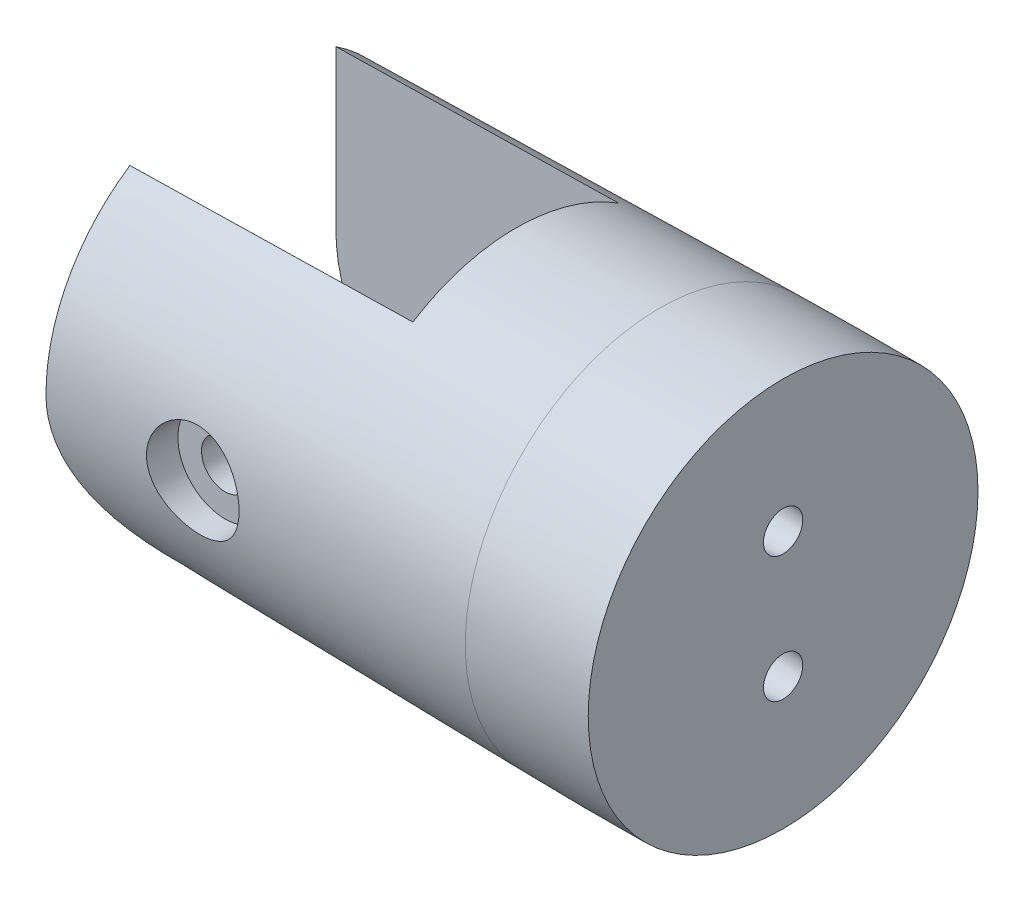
ISO-10303-21;
HEADER;
FILE_DESCRIPTION(('STEP AP214'),'2;1');
FILE_NAME('part.step','',(''),(''),'','','');
FILE_SCHEMA(('AUTOMOTIVE_DESIGN { 1 0 10303 214 1 1 1 1 }'));
ENDSEC;
DATA;
#1=APPLICATION_CONTEXT('core data for automotive mechanical design processes');
#2=APPLICATION_PROTOCOL_DEFINITION('international standard','automotive_design',2000,#1);
#3=PRODUCT_CONTEXT('',#1,'mechanical');
#4=PRODUCT('Part','Part','',(#3));
#5=PRODUCT_RELATED_PRODUCT_CATEGORY('part','',(#4));
#6=PRODUCT_DEFINITION_FORMATION('','',#4);
#7=PRODUCT_DEFINITION_CONTEXT('part definition',#1,'design');
#8=PRODUCT_DEFINITION('design','',#6,#7);
#9=PRODUCT_DEFINITION_SHAPE('','',#8);
#10=(LENGTH_UNIT() NAMED_UNIT(*) SI_UNIT(.MILLI.,.METRE.));
#11=(NAMED_UNIT(*) PLANE_ANGLE_UNIT() SI_UNIT($,.RADIAN.));
#12=(NAMED_UNIT(*) SI_UNIT($,.STERADIAN.) SOLID_ANGLE_UNIT());
#13=UNCERTAINTY_MEASURE_WITH_UNIT(LENGTH_MEASURE(1.E-05),#10,'distance_accuracy_value','');
#14=(GEOMETRIC_REPRESENTATION_CONTEXT(3) GLOBAL_UNCERTAINTY_ASSIGNED_CONTEXT((#13)) GLOBAL_UNIT_ASSIGNED_CONTEXT((#10,
#11,#12)) REPRESENTATION_CONTEXT('',''));
#15=CARTESIAN_POINT('',(0.,0.,0.));
#16=DIRECTION('',(0.,0.,1.));
#17=DIRECTION('',(1.,0.,0.));
#18=AXIS2_PLACEMENT_3D('',#15,#16,#17);
#19=CARTESIAN_POINT('',(0.,0.,0.));
#20=DIRECTION('',(1.,0.,0.));
#21=DIRECTION('',(0.,0.,-1.));
#22=AXIS2_PLACEMENT_3D('',#19,#20,#21);
#23=CONICAL_SURFACE('',#22,12.5,0.0174532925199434);
#24=CARTESIAN_POINT('',(-28.8493114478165,0.120896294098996,0.));
#25=DIRECTION('',(-0.866025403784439,0.5,0.));
#26=DIRECTION('',(0.5,0.866025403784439,0.));
#27=AXIS2_PLACEMENT_3D('',#24,#25,#26);
#28=ELLIPSE('',#27,13.8522881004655,11.9958242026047);
#29=CARTESIAN_POINT('',(-28.9641016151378,-0.0779261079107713,-11.9941765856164));
#30=VERTEX_POINT('',#29);
#31=CARTESIAN_POINT('',(-27.2320508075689,2.92207389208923,-11.6642187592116));
#32=VERTEX_POINT('',#31);
#33=EDGE_CURVE('E11',#30,#32,#28,.F.);
#34=ORIENTED_EDGE('',*,*,#33,.F.);
#35=CARTESIAN_POINT('',(-28.9393019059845,-0.120880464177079,0.));
#36=DIRECTION('',(-0.866025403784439,-0.5,0.));
#37=DIRECTION('',(0.5,-0.866025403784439,0.));
#38=AXIS2_PLACEMENT_3D('',#35,#36,#37);
#39=ELLIPSE('',#38,13.8504743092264,11.994253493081);
#40=CARTESIAN_POINT('',(-27.2320508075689,-3.07792610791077,-11.6240649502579));
#41=VERTEX_POINT('',#40);
#42=EDGE_CURVE('E143',#41,#30,#39,.F.);
#43=ORIENTED_EDGE('',*,*,#42,.F.);
#44=CARTESIAN_POINT('',(-18.540732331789,-3.07792610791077,-11.7809322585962));
#45=CARTESIAN_POINT('',(-21.2914287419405,-3.07792610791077,-11.731307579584));
#46=CARTESIAN_POINT('',(-24.0421247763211,-3.07792610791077,-11.681662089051));
#47=CARTESIAN_POINT('',(-29.5435160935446,-3.07792610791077,-11.5823294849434));
#48=CARTESIAN_POINT('',(-32.2942113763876,-3.07792610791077,-11.5326423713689));
#49=CARTESIAN_POINT('',(-35.0449062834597,-3.07792610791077,-11.4829344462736));
#50=B_SPLINE_CURVE_WITH_KNOTS('',3,(#44,#45,#46,#47,#48,#49),.UNSPECIFIED.,.F.,.F.,(4,2,4),(0.,
8.25343202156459,16.5068640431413),.UNSPECIFIED.);
#51=CARTESIAN_POINT('',(-23.7679491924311,-3.07792610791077,-11.6866039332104));
#52=VERTEX_POINT('',#51);
#53=EDGE_CURVE('E400',#52,#41,#50,.T.);
#54=ORIENTED_EDGE('',*,*,#53,.F.);
#55=CARTESIAN_POINT('',(-21.9204045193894,0.122115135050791,0.));
#56=DIRECTION('',(0.866025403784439,-0.5,0.));
#57=DIRECTION('',(0.5,0.866025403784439,0.));
#58=AXIS2_PLACEMENT_3D('',#55,#56,#57);
#59=ELLIPSE('',#58,13.9919428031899,12.1167625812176);
#60=CARTESIAN_POINT('',(-22.0358983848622,-0.0779261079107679,-12.1151113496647));
#61=VERTEX_POINT('',#60);
#62=EDGE_CURVE('E398',#61,#52,#59,.F.);
#63=ORIENTED_EDGE('',*,*,#62,.F.);
#64=CARTESIAN_POINT('',(-22.0103949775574,-0.122099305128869,0.));
#65=DIRECTION('',(0.866025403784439,0.5,0.));
#66=DIRECTION('',(0.5,-0.866025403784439,0.));
#67=AXIS2_PLACEMENT_3D('',#64,#65,#66);
#68=ELLIPSE('',#67,13.9901290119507,12.1151918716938);
#69=CARTESIAN_POINT('',(-23.7679491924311,2.92207389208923,-11.7265435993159));
#70=VERTEX_POINT('',#69);
#71=EDGE_CURVE('E396',#70,#61,#68,.F.);
#72=ORIENTED_EDGE('',*,*,#71,.F.);
#73=CARTESIAN_POINT('',(-35.0456553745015,2.92207389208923,-11.5235665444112));
#74=CARTESIAN_POINT('',(-32.2949573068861,2.92207389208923,-11.5730992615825));
#75=CARTESIAN_POINT('',(-29.5442589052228,2.92207389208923,-11.6226134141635));
#76=CARTESIAN_POINT('',(-24.0428614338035,2.92207389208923,-11.7216045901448));
#77=CARTESIAN_POINT('',(-21.2921623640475,2.92207389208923,-11.7710816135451));
#78=CARTESIAN_POINT('',(-18.5414629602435,2.92207389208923,-11.8205400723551));
#79=B_SPLINE_CURVE_WITH_KNOTS('',3,(#73,#74,#75,#76,#77,#78),.UNSPECIFIED.,.F.,.F.,(4,2,4),(0.,
8.25343202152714,16.5068640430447),.UNSPECIFIED.);
#80=EDGE_CURVE('E41',#32,#70,#79,.T.);
#81=ORIENTED_EDGE('',*,*,#80,.F.);
#82=EDGE_LOOP('',(#34,#43,#54,#63,#72,#81));
#83=FACE_BOUND('',#82,.T.);
#84=CARTESIAN_POINT('',(-25.2077489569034,-10.1257467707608,6.55078487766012));
#85=CARTESIAN_POINT('',(-25.384900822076,-10.1221080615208,6.5506524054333));
#86=CARTESIAN_POINT('',(-25.5618665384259,-10.1136800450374,6.55805643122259));
#87=CARTESIAN_POINT('',(-25.9136256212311,-10.0876287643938,6.58686788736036));
#88=CARTESIAN_POINT('',(-26.0884226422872,-10.0700240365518,6.60824711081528));
#89=CARTESIAN_POINT('',(-26.4321959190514,-10.0263122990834,6.66353347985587));
#90=CARTESIAN_POINT('',(-26.6012200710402,-10.0003354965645,6.69724977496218));
#91=CARTESIAN_POINT('',(-26.9352991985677,-9.94031715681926,6.7756660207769));
#92=CARTESIAN_POINT('',(-27.1003518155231,-9.90627095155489,6.8203723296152));
#93=CARTESIAN_POINT('',(-27.4923459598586,-9.8151956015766,6.93922375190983));
#94=CARTESIAN_POINT('',(-27.7170422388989,-9.7544582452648,7.01793591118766));
#95=CARTESIAN_POINT('',(-28.1568140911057,-9.61934879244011,7.18919912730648));
#96=CARTESIAN_POINT('',(-28.3718856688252,-9.5449710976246,7.28175586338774));
#97=CARTESIAN_POINT('',(-28.7942205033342,-9.38292835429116,7.47759369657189));
#98=CARTESIAN_POINT('',(-29.0014063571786,-9.29516051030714,7.58095562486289));
#99=CARTESIAN_POINT('',(-29.4064553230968,-9.10749111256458,7.79454986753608));
#100=CARTESIAN_POINT('',(-29.6043186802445,-9.0075898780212,7.90478200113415));
#101=CARTESIAN_POINT('',(-30.0770813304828,-8.74908069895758,8.17947708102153));
#102=CARTESIAN_POINT('',(-30.3471602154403,-8.58410669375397,8.34627965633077));
#103=CARTESIAN_POINT('',(-30.8694224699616,-8.23033464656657,8.68279453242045));
#104=CARTESIAN_POINT('',(-31.1215982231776,-8.04152655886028,8.85250803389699));
#105=CARTESIAN_POINT('',(-31.6072594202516,-7.64076012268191,9.18960814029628));
#106=CARTESIAN_POINT('',(-31.840787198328,-7.42885695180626,9.3569992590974));
#107=CARTESIAN_POINT('',(-32.288825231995,-6.98160075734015,9.68564781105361));
#108=CARTESIAN_POINT('',(-32.5033428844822,-6.74625693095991,9.84690761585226));
#109=CARTESIAN_POINT('',(-32.8673243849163,-6.30593750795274,10.1254176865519));
#110=CARTESIAN_POINT('',(-33.0207898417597,-6.10548895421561,10.2446118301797));
#111=CARTESIAN_POINT('',(-33.3139916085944,-5.69046464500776,10.47499878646));
#112=CARTESIAN_POINT('',(-33.4537307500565,-5.47589181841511,10.586193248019));
#113=CARTESIAN_POINT('',(-33.7180847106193,-5.03314953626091,10.7986228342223));
#114=CARTESIAN_POINT('',(-33.8427103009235,-4.8049899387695,10.8998650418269));
#115=CARTESIAN_POINT('',(-34.0754226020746,-4.33566742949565,11.0905432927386));
#116=CARTESIAN_POINT('',(-34.1835127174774,-4.09450720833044,11.1799817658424));
#117=CARTESIAN_POINT('',(-34.3649477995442,-3.64171683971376,11.3313153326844));
#118=CARTESIAN_POINT('',(-34.4410800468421,-3.43190394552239,11.3953147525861));
#119=CARTESIAN_POINT('',(-34.5798083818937,-3.00499034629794,11.5127546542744));
#120=CARTESIAN_POINT('',(-34.6424072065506,-2.7878911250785,11.5661972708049));
#121=CARTESIAN_POINT('',(-34.7530977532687,-2.34791756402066,11.6614924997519));
#122=CARTESIAN_POINT('',(-34.80121304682,-2.12505325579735,11.7033639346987));
#123=CARTESIAN_POINT('',(-34.8822899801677,-1.67472463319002,11.7748098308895));
#124=CARTESIAN_POINT('',(-34.9152587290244,-1.44726252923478,11.8043900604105));
#125=CARTESIAN_POINT('',(-34.9601765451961,-1.03777358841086,11.8457806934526));
#126=CARTESIAN_POINT('',(-34.975096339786,-0.856310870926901,11.8600260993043));
#127=CARTESIAN_POINT('',(-34.9950156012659,-0.49248994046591,11.8803561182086));
#128=CARTESIAN_POINT('',(-35.0000205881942,-0.310132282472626,11.8864452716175));
#129=CARTESIAN_POINT('',(-34.999999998,-0.12770498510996,11.8883868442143));
#130=B_SPLINE_CURVE_WITH_KNOTS('',3,(#84,#85,#86,#87,#88,#89,#90,#91,#92,#93,#94,#95,#96,#97,
#98,#99,#100,#101,#102,#103,#104,#105,#106,#107,#108,#109,#110,#111,#112,#113,#114,#115,#116,
#117,#118,#119,#120,#121,#122,#123,#124,#125,#126,#127,#128,#129),.UNSPECIFIED.,.F.,.F.,(4,2,2,
2,2,2,2,2,2,2,2,2,2,2,2,2,2,2,2,2,2,2,4),(0.,0.531211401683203,1.06135392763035,
1.58361996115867,2.10618885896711,2.84211368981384,3.57834123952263,4.32053514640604,
5.06270953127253,6.13454749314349,7.20683873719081,8.27662206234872,9.34598728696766,
10.1827819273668,11.0194035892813,11.8554254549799,12.691274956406,13.3871606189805,
14.0829054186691,14.7775117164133,15.4717916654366,16.0192479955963,16.5663994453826),.UNSPECIFIED.);
#131=CARTESIAN_POINT('',(-25.2079489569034,-10.1257426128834,6.55078487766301));
#132=VERTEX_POINT('',#131);
#133=CARTESIAN_POINT('',(-35.,-0.127904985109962,11.888384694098));
#134=VERTEX_POINT('',#133);
#135=EDGE_CURVE('E213',#132,#134,#130,.T.);
#136=ORIENTED_EDGE('',*,*,#135,.F.);
#137=CARTESIAN_POINT('',(-25.9999999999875,-10.1092684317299,0.));
#138=DIRECTION('',(0.020794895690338,0.999783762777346,0.));
#139=DIRECTION('',(0.999783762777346,-0.020794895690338,0.));
#140=AXIS2_PLACEMENT_3D('',#137,#138,#139);
#141=ELLIPSE('',#140,579.284863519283,6.55079100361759);
#142=CARTESIAN_POINT('',(-17.,-10.29646297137,6.55));
#143=VERTEX_POINT('',#142);
#144=EDGE_CURVE('E204',#143,#132,#141,.F.);
#145=ORIENTED_EDGE('',*,*,#144,.F.);
#146=CARTESIAN_POINT('',(-17.,0.,0.));
#147=DIRECTION('',(1.,0.,0.));
#148=DIRECTION('',(0.,0.,-1.));
#149=AXIS2_PLACEMENT_3D('',#146,#147,#148);
#150=CIRCLE('',#149,12.2032638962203);
#151=CARTESIAN_POINT('',(-17.,-10.29646297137,-6.55));
#152=VERTEX_POINT('',#151);
#153=EDGE_CURVE('E275',#152,#143,#150,.F.);
#154=ORIENTED_EDGE('',*,*,#153,.F.);
#155=CARTESIAN_POINT('',(-25.2079489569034,-10.1257426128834,-6.55078487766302));
#156=VERTEX_POINT('',#155);
#157=EDGE_CURVE('E207',#156,#152,#141,.F.);
#158=ORIENTED_EDGE('',*,*,#157,.F.);
#159=CARTESIAN_POINT('',(-34.999999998,-0.127704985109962,-11.8883868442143));
#160=CARTESIAN_POINT('',(-35.0000038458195,-0.247899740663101,-11.8870974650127));
#161=CARTESIAN_POINT('',(-34.9978372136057,-0.368057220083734,-11.8840191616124));
#162=CARTESIAN_POINT('',(-34.9891873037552,-0.608065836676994,-11.8743089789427));
#163=CARTESIAN_POINT('',(-34.9827042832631,-0.727916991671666,-11.8676773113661));
#164=CARTESIAN_POINT('',(-34.9568334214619,-1.08645332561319,-11.8425043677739));
#165=CARTESIAN_POINT('',(-34.9310236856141,-1.32435489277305,-11.818682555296));
#166=CARTESIAN_POINT('',(-34.8630441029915,-1.79412570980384,-11.7577090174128));
#167=CARTESIAN_POINT('',(-34.8210012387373,-2.02602722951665,-11.7206609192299));
#168=CARTESIAN_POINT('',(-34.7212875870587,-2.4840685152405,-11.6339798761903));
#169=CARTESIAN_POINT('',(-34.6636146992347,-2.71020750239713,-11.5843452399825));
#170=CARTESIAN_POINT('',(-34.5337541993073,-3.15461555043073,-11.4736362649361));
#171=CARTESIAN_POINT('',(-34.4616096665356,-3.37290575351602,-11.4125959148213));
#172=CARTESIAN_POINT('',(-34.3036704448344,-3.80130449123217,-11.2800529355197));
#173=CARTESIAN_POINT('',(-34.2178697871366,-4.01140939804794,-11.2085457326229));
#174=CARTESIAN_POINT('',(-34.0335365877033,-4.42279683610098,-11.0561528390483));
#175=CARTESIAN_POINT('',(-33.9349865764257,-4.62406674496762,-10.9752542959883));
#176=CARTESIAN_POINT('',(-33.7262261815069,-5.01692110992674,-10.8053481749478));
#177=CARTESIAN_POINT('',(-33.6160133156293,-5.20850349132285,-10.7163388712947));
#178=CARTESIAN_POINT('',(-33.3420067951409,-5.65070971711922,-10.4971375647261));
#179=CARTESIAN_POINT('',(-33.1734886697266,-5.89691498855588,-10.3639041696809));
#180=CARTESIAN_POINT('',(-32.8182738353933,-6.36987046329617,-10.0874601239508));
#181=CARTESIAN_POINT('',(-32.6315708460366,-6.5966138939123,-9.94424603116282));
#182=CARTESIAN_POINT('',(-32.2410442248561,-7.03100678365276,-9.65045731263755));
#183=CARTESIAN_POINT('',(-32.0371758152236,-7.23860314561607,-9.49986389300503));
#184=CARTESIAN_POINT('',(-31.6138465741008,-7.63396391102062,-9.19477454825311));
#185=CARTESIAN_POINT('',(-31.3943879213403,-7.82173107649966,-9.04027917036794));
#186=CARTESIAN_POINT('',(-30.9361163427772,-8.18078312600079,-8.72778529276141));
#187=CARTESIAN_POINT('',(-30.6970182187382,-8.35169409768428,-8.56977531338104));
#188=CARTESIAN_POINT('',(-30.2030090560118,-8.67281902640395,-8.25714523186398));
#189=CARTESIAN_POINT('',(-29.9480915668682,-8.82302445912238,-8.10252654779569));
#190=CARTESIAN_POINT('',(-29.4226292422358,-9.10167320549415,-7.80228981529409));
#191=CARTESIAN_POINT('',(-29.1521301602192,-9.2301762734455,-7.65664777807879));
#192=CARTESIAN_POINT('',(-28.5942851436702,-9.46453414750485,-7.3808197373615));
#193=CARTESIAN_POINT('',(-28.3069575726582,-9.57041307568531,-7.25061733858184));
#194=CARTESIAN_POINT('',(-27.6895711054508,-9.7652882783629,-7.00473322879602));
#195=CARTESIAN_POINT('',(-27.3579444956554,-9.85215677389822,-6.89115067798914));
#196=CARTESIAN_POINT('',(-26.8473243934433,-9.9573252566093,-6.75344924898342));
#197=CARTESIAN_POINT('',(-26.6752250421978,-9.98816113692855,-6.71303533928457));
#198=CARTESIAN_POINT('',(-26.3272532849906,-10.0409926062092,-6.64476535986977));
#199=CARTESIAN_POINT('',(-26.1513833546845,-10.0629938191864,-6.61690129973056));
#200=CARTESIAN_POINT('',(-25.8475507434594,-10.0927364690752,-6.5811352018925));
#201=CARTESIAN_POINT('',(-25.7202040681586,-10.1027543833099,-6.56980845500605));
#202=CARTESIAN_POINT('',(-25.4645171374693,-10.1179356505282,-6.55460713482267));
#203=CARTESIAN_POINT('',(-25.3361753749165,-10.1230889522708,-6.55074797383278));
#204=CARTESIAN_POINT('',(-25.2077489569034,-10.1257467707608,-6.55078487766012));
#205=B_SPLINE_CURVE_WITH_KNOTS('',3,(#159,#160,#161,#162,#163,#164,#165,#166,#167,#168,#169,
#170,#171,#172,#173,#174,#175,#176,#177,#178,#179,#180,#181,#182,#183,#184,#185,#186,#187,#188,
#189,#190,#191,#192,#193,#194,#195,#196,#197,#198,#199,#200,#201,#202,#203,#204),.UNSPECIFIED.,
.F.,.F.,(4,2,2,2,2,2,2,2,2,2,2,2,2,2,2,2,2,2,2,2,2,2,4),(0.,0.360536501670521,0.72105152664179,
1.44138371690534,2.15619172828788,2.87109584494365,3.58390259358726,4.29702175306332,
5.01112860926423,5.72538775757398,6.70423575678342,7.68342302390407,8.66524881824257,
9.64693767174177,10.6469855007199,11.6474438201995,12.645100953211,13.6416890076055,
14.7209105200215,15.2586937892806,15.7961341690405,16.1805629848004,16.5657843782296),.UNSPECIFIED.);
#206=CARTESIAN_POINT('',(-35.,-0.127904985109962,-11.888384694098));
#207=VERTEX_POINT('',#206);
#208=EDGE_CURVE('E220',#207,#156,#205,.T.);
#209=ORIENTED_EDGE('',*,*,#208,.F.);
#210=CARTESIAN_POINT('',(-35.,0.,0.));
#211=DIRECTION('',(1.,0.,0.));
#212=DIRECTION('',(0.,0.,-1.));
#213=AXIS2_PLACEMENT_3D('',#210,#211,#212);
#214=CIRCLE('',#213,11.8890727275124);
#215=CARTESIAN_POINT('',(-35.,9.92207389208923,-6.55));
#216=VERTEX_POINT('',#215);
#217=EDGE_CURVE('E259',#207,#216,#214,.T.);
#218=ORIENTED_EDGE('',*,*,#217,.T.);
#219=CARTESIAN_POINT('',(-6.99447381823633,10.5028653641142,-6.55));
#220=CARTESIAN_POINT('',(-10.9143463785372,10.4222279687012,-6.55));
#221=CARTESIAN_POINT('',(-14.8342136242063,10.341331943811,-6.55));
#222=CARTESIAN_POINT('',(-22.6739364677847,10.1789819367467,-6.55));
#223=CARTESIAN_POINT('',(-26.5937920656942,10.0975279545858,-6.55));
#224=CARTESIAN_POINT('',(-34.4334907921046,9.93402133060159,-6.55));
#225=CARTESIAN_POINT('',(-38.3533339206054,9.8519686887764,-6.55));
#226=CARTESIAN_POINT('',(-46.1930066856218,9.68721706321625,-6.55));
#227=CARTESIAN_POINT('',(-50.112836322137,9.60451807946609,-6.55));
#228=CARTESIAN_POINT('',(-54.0326586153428,9.52147208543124,-6.55));
#229=B_SPLINE_CURVE_WITH_KNOTS('',3,(#219,#220,#221,#222,#223,#224,#225,#226,#227,#228),
.UNSPECIFIED.,.F.,.F.,(4,2,2,2,4),(0.,11.7621056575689,23.5242110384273,35.2863164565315,
47.048422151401),.UNSPECIFIED.);
#230=CARTESIAN_POINT('',(-17.,10.29646297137,-6.55));
#231=VERTEX_POINT('',#230);
#232=EDGE_CURVE('E252',#231,#216,#229,.T.);
#233=ORIENTED_EDGE('',*,*,#232,.F.);
#234=CARTESIAN_POINT('',(-17.,10.29646297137,6.55));
#235=VERTEX_POINT('',#234);
#236=EDGE_CURVE('E273',#235,#231,#150,.F.);
#237=ORIENTED_EDGE('',*,*,#236,.F.);
#238=CARTESIAN_POINT('',(-54.0326586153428,9.52147208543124,6.55));
#239=CARTESIAN_POINT('',(-50.112836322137,9.60451807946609,6.55));
#240=CARTESIAN_POINT('',(-46.1930066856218,9.68721706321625,6.55));
#241=CARTESIAN_POINT('',(-38.3533339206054,9.8519686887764,6.55));
#242=CARTESIAN_POINT('',(-34.4334907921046,9.93402133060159,6.55));
#243=CARTESIAN_POINT('',(-26.5937920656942,10.0975279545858,6.55));
#244=CARTESIAN_POINT('',(-22.6739364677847,10.1789819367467,6.55));
#245=CARTESIAN_POINT('',(-14.8342136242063,10.341331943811,6.55));
#246=CARTESIAN_POINT('',(-10.9143463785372,10.4222279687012,6.55));
#247=CARTESIAN_POINT('',(-6.99447381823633,10.5028653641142,6.55));
#248=B_SPLINE_CURVE_WITH_KNOTS('',3,(#238,#239,#240,#241,#242,#243,#244,#245,#246,#247),
.UNSPECIFIED.,.F.,.F.,(4,2,2,2,4),(0.,11.7621056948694,23.5242111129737,35.2863164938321,
47.048422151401),.UNSPECIFIED.);
#249=CARTESIAN_POINT('',(-35.,9.92207389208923,6.55));
#250=VERTEX_POINT('',#249);
#251=EDGE_CURVE('E260',#250,#235,#248,.T.);
#252=ORIENTED_EDGE('',*,*,#251,.F.);
#253=EDGE_CURVE('E266',#250,#134,#214,.T.);
#254=ORIENTED_EDGE('',*,*,#253,.T.);
#255=EDGE_LOOP('',(#136,#145,#154,#158,#209,#218,#233,#237,#252,#254));
#256=FACE_BOUND('',#255,.T.);
#257=CARTESIAN_POINT('',(-7.85457999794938,0.,0.));
#258=DIRECTION('',(1.,0.,0.));
#259=DIRECTION('',(0.,0.,-1.));
#260=AXIS2_PLACEMENT_3D('',#257,#258,#259);
#261=CIRCLE('',#260,12.3628977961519);
#262=CARTESIAN_POINT('',(-7.85457999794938,0.,-12.3628977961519));
#263=VERTEX_POINT('',#262);
#264=EDGE_CURVE('E282',#263,#263,#261,.F.);
#265=ORIENTED_EDGE('',*,*,#264,.T.);
#266=EDGE_LOOP('',(#265));
#267=FACE_BOUND('',#266,.T.);
#268=CARTESIAN_POINT('',(-27.6265811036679,-2.19397261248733,11.8158127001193));
#269=CARTESIAN_POINT('',(-27.7451359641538,-2.0748219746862,11.8358302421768));
#270=CARTESIAN_POINT('',(-27.8536854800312,-1.94566585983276,11.8560253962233));
#271=CARTESIAN_POINT('',(-28.0477905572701,-1.67075461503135,11.8944571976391));
#272=CARTESIAN_POINT('',(-28.1333339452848,-1.524990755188,11.9126928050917));
#273=CARTESIAN_POINT('',(-28.2789507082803,-1.22068284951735,11.9451542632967));
#274=CARTESIAN_POINT('',(-28.3390063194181,-1.06212998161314,11.9593773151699));
#275=CARTESIAN_POINT('',(-28.4316274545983,-0.736824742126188,11.9821965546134));
#276=CARTESIAN_POINT('',(-28.4642002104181,-0.570074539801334,11.990794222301));
#277=CARTESIAN_POINT('',(-28.5004438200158,-0.236185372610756,12.0013409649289));
#278=CARTESIAN_POINT('',(-28.504605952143,-0.0691032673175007,12.0034027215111));
#279=CARTESIAN_POINT('',(-28.4851690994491,0.26338649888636,12.0010508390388));
#280=CARTESIAN_POINT('',(-28.4615712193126,0.428794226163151,11.996637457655));
#281=CARTESIAN_POINT('',(-28.3878392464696,0.75116834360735,11.9820377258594));
#282=CARTESIAN_POINT('',(-28.3380322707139,0.908213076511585,11.9719224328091));
#283=CARTESIAN_POINT('',(-28.2136005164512,1.21175838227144,11.9472015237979));
#284=CARTESIAN_POINT('',(-28.1389733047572,1.35825791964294,11.9325954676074));
#285=CARTESIAN_POINT('',(-27.9655732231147,1.63923923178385,11.9003363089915));
#286=CARTESIAN_POINT('',(-27.8664184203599,1.7734798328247,11.8826364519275));
#287=CARTESIAN_POINT('',(-27.6473201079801,2.02366232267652,11.8464779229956));
#288=CARTESIAN_POINT('',(-27.5273736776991,2.13960163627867,11.8280191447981));
#289=CARTESIAN_POINT('',(-27.2673291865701,2.35215199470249,11.7922409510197));
#290=CARTESIAN_POINT('',(-27.126888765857,2.44834970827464,11.7749501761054));
#291=CARTESIAN_POINT('',(-26.8314540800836,2.61577964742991,11.744177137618));
#292=CARTESIAN_POINT('',(-26.6764610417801,2.68701397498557,11.7306945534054));
#293=CARTESIAN_POINT('',(-26.3579248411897,2.8017132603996,11.7095463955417));
#294=CARTESIAN_POINT('',(-26.1944851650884,2.8454543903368,11.7018228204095));
#295=CARTESIAN_POINT('',(-25.8624175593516,2.90487292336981,11.6931886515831));
#296=CARTESIAN_POINT('',(-25.6937905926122,2.92055550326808,11.6922768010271));
#297=CARTESIAN_POINT('',(-25.3606368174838,2.92334685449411,11.6975725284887));
#298=CARTESIAN_POINT('',(-25.1961125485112,2.91115792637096,11.7036032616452));
#299=CARTESIAN_POINT('',(-24.8716267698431,2.86012154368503,11.7220091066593));
#300=CARTESIAN_POINT('',(-24.7116653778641,2.82127340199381,11.7343843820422));
#301=CARTESIAN_POINT('',(-24.4003691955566,2.71809928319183,11.7642867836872));
#302=CARTESIAN_POINT('',(-24.2490517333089,2.65372405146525,11.7818238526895));
#303=CARTESIAN_POINT('',(-23.9592539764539,2.50139755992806,11.820270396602));
#304=CARTESIAN_POINT('',(-23.8207758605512,2.4134423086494,11.8411804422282));
#305=CARTESIAN_POINT('',(-23.5564260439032,2.21352418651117,11.8848909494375));
#306=CARTESIAN_POINT('',(-23.4310172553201,2.10095678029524,11.9077279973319));
#307=CARTESIAN_POINT('',(-23.2006772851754,1.85632939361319,11.9523737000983));
#308=CARTESIAN_POINT('',(-23.095748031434,1.72426758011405,11.974182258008));
#309=CARTESIAN_POINT('',(-22.9081835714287,1.44242505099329,12.0147066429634));
#310=CARTESIAN_POINT('',(-22.8258236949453,1.29245502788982,12.0333832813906));
#311=CARTESIAN_POINT('',(-22.6876217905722,0.980214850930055,12.0652494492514));
#312=CARTESIAN_POINT('',(-22.6317751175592,0.817946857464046,12.07843993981));
#313=CARTESIAN_POINT('',(-22.54945354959,0.489729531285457,12.0975789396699));
#314=CARTESIAN_POINT('',(-22.5223263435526,0.32395334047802,12.1036885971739));
#315=CARTESIAN_POINT('',(-22.4961031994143,-0.00989612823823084,12.1084750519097));
#316=CARTESIAN_POINT('',(-22.4970027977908,-0.177969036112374,12.1071530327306));
#317=CARTESIAN_POINT('',(-22.5264045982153,-0.507370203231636,12.0972601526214));
#318=CARTESIAN_POINT('',(-22.5542441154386,-0.668763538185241,12.0888639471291));
#319=CARTESIAN_POINT('',(-22.6356042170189,-0.984465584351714,12.0658341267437));
#320=CARTESIAN_POINT('',(-22.6891261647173,-1.13877391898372,12.0512001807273));
#321=CARTESIAN_POINT('',(-22.820834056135,-1.43771166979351,12.0169072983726));
#322=CARTESIAN_POINT('',(-22.8992599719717,-1.58222957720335,11.9971998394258));
#323=CARTESIAN_POINT('',(-23.0783572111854,-1.85625433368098,11.9547058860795));
#324=CARTESIAN_POINT('',(-23.1790327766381,-1.98575831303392,11.9319188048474));
#325=CARTESIAN_POINT('',(-23.4034264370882,-2.23031047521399,11.8846913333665));
#326=CARTESIAN_POINT('',(-23.5277601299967,-2.34478870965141,11.8602216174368));
#327=CARTESIAN_POINT('',(-23.7940437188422,-2.55140875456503,11.8127434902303));
#328=CARTESIAN_POINT('',(-23.9359950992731,-2.64354868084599,11.7897352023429));
#329=CARTESIAN_POINT('',(-24.2351863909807,-2.80359714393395,11.7473428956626));
#330=CARTESIAN_POINT('',(-24.39255397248,-2.87127693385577,11.7279938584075));
#331=CARTESIAN_POINT('',(-24.7170610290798,-2.97899751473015,11.69525366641));
#332=CARTESIAN_POINT('',(-24.8841982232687,-3.01904472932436,11.6818611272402));
#333=CARTESIAN_POINT('',(-25.2186997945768,-3.06936420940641,11.6627024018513));
#334=CARTESIAN_POINT('',(-25.3859365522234,-3.08041013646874,11.6567403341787));
#335=CARTESIAN_POINT('',(-25.720021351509,-3.07450641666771,11.6522681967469));
#336=CARTESIAN_POINT('',(-25.8868694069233,-3.05755777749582,11.6537578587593));
#337=CARTESIAN_POINT('',(-26.2115602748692,-2.99689301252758,11.6636504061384));
#338=CARTESIAN_POINT('',(-26.369520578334,-2.95377614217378,11.6718999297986));
#339=CARTESIAN_POINT('',(-26.675948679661,-2.84264834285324,11.6939548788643));
#340=CARTESIAN_POINT('',(-26.8244200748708,-2.77464691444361,11.7077581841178));
#341=CARTESIAN_POINT('',(-27.0873491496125,-2.6273614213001,11.7369070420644));
#342=CARTESIAN_POINT('',(-27.2036105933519,-2.55116551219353,11.751734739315));
#343=CARTESIAN_POINT('',(-27.4243742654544,-2.38357003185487,11.7829388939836));
#344=CARTESIAN_POINT('',(-27.5288755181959,-2.2921692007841,11.7993154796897));
#345=CARTESIAN_POINT('',(-27.6265811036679,-2.19397261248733,11.8158127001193));
#346=B_SPLINE_CURVE_WITH_KNOTS('',3,(#268,#269,#270,#271,#272,#273,#274,#275,#276,#277,#278,
#279,#280,#281,#282,#283,#284,#285,#286,#287,#288,#289,#290,#291,#292,#293,#294,#295,#296,#297,
#298,#299,#300,#301,#302,#303,#304,#305,#306,#307,#308,#309,#310,#311,#312,#313,#314,#315,#316,
#317,#318,#319,#320,#321,#322,#323,#324,#325,#326,#327,#328,#329,#330,#331,#332,#333,#334,#335,
#336,#337,#338,#339,#340,#341,#342,#343,#344,#345),.UNSPECIFIED.,.T.,.F.,(4,2,2,2,2,2,2,2,2,2,2,
2,2,2,2,2,2,2,2,2,2,2,2,2,2,2,2,2,2,2,2,2,2,2,2,2,2,2,4),(0.,0.507323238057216,1.01491439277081,
1.5228587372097,2.03066938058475,2.52967617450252,3.02866311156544,3.52156493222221,
4.01451508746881,4.51568642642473,5.01692822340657,5.52778308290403,6.03859491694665,
6.54418995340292,7.04969169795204,7.54259669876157,8.03551440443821,8.52938786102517,
9.02334497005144,9.53116599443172,10.0390347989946,10.5528482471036,11.0665716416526,
11.568358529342,12.070065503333,12.5597368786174,13.049434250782,13.5440012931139,
14.0386627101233,14.5486006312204,15.0585815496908,15.5732153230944,16.0877294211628,
16.5883715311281,17.0889956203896,17.5785665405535,18.067950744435,18.4860205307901,
18.904124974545),.UNSPECIFIED.);
#347=CARTESIAN_POINT('',(-27.6265811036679,-2.19397261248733,11.8158127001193));
#348=VERTEX_POINT('',#347);
#349=EDGE_CURVE('E306',#348,#348,#346,.T.);
#350=ORIENTED_EDGE('',*,*,#349,.T.);
#351=EDGE_LOOP('',(#350));
#352=FACE_BOUND('',#351,.T.);
#353=ADVANCED_FACE('F33',(#83,#256,#267,#352),#23,.T.);
#354=CARTESIAN_POINT('',(-25.5,-0.0779261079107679,-12.5));
#355=DIRECTION('',(0.,0.,1.));
#356=DIRECTION('',(1.,0.,0.));
#357=AXIS2_PLACEMENT_3D('',#354,#355,#356);
#358=CYLINDRICAL_SURFACE('',#357,1.5);
#359=CARTESIAN_POINT('',(-25.5,-0.0779261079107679,6.55));
#360=DIRECTION('',(0.,0.,1.));
#361=DIRECTION('',(1.,0.,0.));
#362=AXIS2_PLACEMENT_3D('',#359,#360,#361);
#363=CIRCLE('',#362,1.5);
#364=CARTESIAN_POINT('',(-24.,-0.0779261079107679,6.55));
#365=VERTEX_POINT('',#364);
#366=EDGE_CURVE('E196',#365,#365,#363,.T.);
#367=ORIENTED_EDGE('',*,*,#366,.F.);
#368=EDGE_LOOP('',(#367));
#369=FACE_BOUND('',#368,.T.);
#370=CARTESIAN_POINT('',(-25.5,-0.0779261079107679,10.));
#371=DIRECTION('',(0.,0.,1.));
#372=DIRECTION('',(1.,0.,0.));
#373=AXIS2_PLACEMENT_3D('',#370,#371,#372);
#374=CIRCLE('',#373,1.5);
#375=CARTESIAN_POINT('',(-24.,-0.0779261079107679,10.));
#376=VERTEX_POINT('',#375);
#377=EDGE_CURVE('E191',#376,#376,#374,.F.);
#378=ORIENTED_EDGE('',*,*,#377,.F.);
#379=EDGE_LOOP('',(#378));
#380=FACE_BOUND('',#379,.T.);
#381=ADVANCED_FACE('F326',(#369,#380),#358,.F.);
#382=CARTESIAN_POINT('',(-35.,0.,0.));
#383=DIRECTION('',(1.,0.,0.));
#384=DIRECTION('',(0.,0.,-1.));
#385=AXIS2_PLACEMENT_3D('',#382,#383,#384);
#386=PLANE('',#385);
#387=DIRECTION('',(0.,0.,1.));
#388=VECTOR('',#387,1.);
#389=CARTESIAN_POINT('',(-35.,-0.127904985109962,-12.5));
#390=LINE('',#389,#388);
#391=CARTESIAN_POINT('',(-35.,-0.127904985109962,-6.55));
#392=VERTEX_POINT('',#391);
#393=EDGE_CURVE('E200',#207,#392,#390,.T.);
#394=ORIENTED_EDGE('',*,*,#393,.T.);
#395=DIRECTION('',(0.,1.,0.));
#396=VECTOR('',#395,1.);
#397=CARTESIAN_POINT('',(-35.,0.,-6.55));
#398=LINE('',#397,#396);
#399=EDGE_CURVE('E270',#392,#216,#398,.T.);
#400=ORIENTED_EDGE('',*,*,#399,.T.);
#401=ORIENTED_EDGE('',*,*,#217,.F.);
#402=EDGE_LOOP('',(#394,#400,#401));
#403=FACE_BOUND('',#402,.T.);
#404=ADVANCED_FACE('F331',(#403),#386,.F.);
#405=CARTESIAN_POINT('',(-35.,-0.127904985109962,6.55));
#406=VERTEX_POINT('',#405);
#407=EDGE_CURVE('E197',#406,#134,#390,.T.);
#408=ORIENTED_EDGE('',*,*,#407,.T.);
#409=ORIENTED_EDGE('',*,*,#253,.F.);
#410=DIRECTION('',(0.,-1.,0.));
#411=VECTOR('',#410,1.);
#412=CARTESIAN_POINT('',(-35.,0.,6.55));
#413=LINE('',#412,#411);
#414=EDGE_CURVE('E267',#250,#406,#413,.T.);
#415=ORIENTED_EDGE('',*,*,#414,.T.);
#416=EDGE_LOOP('',(#408,#409,#415));
#417=FACE_BOUND('',#416,.T.);
#418=ADVANCED_FACE('F248',(#417),#386,.F.);
#419=CARTESIAN_POINT('',(-35.,-12.5,-6.55));
#420=DIRECTION('',(0.,0.,-1.));
#421=DIRECTION('',(-1.,0.,0.));
#422=AXIS2_PLACEMENT_3D('',#419,#420,#421);
#423=PLANE('',#422);
#424=CARTESIAN_POINT('',(-25.5,-0.0779261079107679,-6.55));
#425=DIRECTION('',(0.,0.,-1.));
#426=DIRECTION('',(-1.,0.,0.));
#427=AXIS2_PLACEMENT_3D('',#424,#425,#426);
#428=CIRCLE('',#427,1.5);
#429=CARTESIAN_POINT('',(-27.,-0.0779261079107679,-6.55));
#430=VERTEX_POINT('',#429);
#431=EDGE_CURVE('E192',#430,#430,#428,.T.);
#432=ORIENTED_EDGE('',*,*,#431,.T.);
#433=EDGE_LOOP('',(#432));
#434=FACE_BOUND('',#433,.T.);
#435=ORIENTED_EDGE('',*,*,#399,.F.);
#436=CARTESIAN_POINT('',(-25.,-0.12790498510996,-6.55));
#437=DIRECTION('',(0.,0.,-1.));
#438=DIRECTION('',(-1.,0.,0.));
#439=AXIS2_PLACEMENT_3D('',#436,#437,#438);
#440=CIRCLE('',#439,10.);
#441=CARTESIAN_POINT('',(-25.2079489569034,-10.1257426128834,-6.55));
#442=VERTEX_POINT('',#441);
#443=EDGE_CURVE('E210',#392,#442,#440,.F.);
#444=ORIENTED_EDGE('',*,*,#443,.T.);
#445=DIRECTION('',(0.999783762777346,-0.020794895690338,0.));
#446=VECTOR('',#445,1.);
#447=CARTESIAN_POINT('',(-34.9464038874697,-9.92318865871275,-6.55));
#448=LINE('',#447,#446);
#449=EDGE_CURVE('E206',#442,#152,#448,.T.);
#450=ORIENTED_EDGE('',*,*,#449,.T.);
#451=DIRECTION('',(0.,1.,0.));
#452=VECTOR('',#451,1.);
#453=CARTESIAN_POINT('',(-17.,-12.5,-6.55));
#454=LINE('',#453,#452);
#455=EDGE_CURVE('E598',#152,#231,#454,.T.);
#456=ORIENTED_EDGE('',*,*,#455,.T.);
#457=ORIENTED_EDGE('',*,*,#232,.T.);
#458=EDGE_LOOP('',(#435,#444,#450,#456,#457));
#459=FACE_BOUND('',#458,.T.);
#460=ADVANCED_FACE('F243',(#434,#459),#423,.F.);
#461=CARTESIAN_POINT('',(-17.,-12.5,-6.55));
#462=DIRECTION('',(1.,0.,0.));
#463=DIRECTION('',(0.,0.,-1.));
#464=AXIS2_PLACEMENT_3D('',#461,#462,#463);
#465=PLANE('',#464);
#466=CARTESIAN_POINT('',(-17.,4.,0.));
#467=DIRECTION('',(1.,0.,0.));
#468=DIRECTION('',(0.,0.,-1.));
#469=AXIS2_PLACEMENT_3D('',#466,#467,#468);
#470=CIRCLE('',#469,4.303785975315);
#471=CARTESIAN_POINT('',(-17.,4.,-4.303785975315));
#472=VERTEX_POINT('',#471);
#473=CARTESIAN_POINT('',(-17.,0.,1.5882612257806));
#474=VERTEX_POINT('',#473);
#475=EDGE_CURVE('E288',#472,#474,#470,.T.);
#476=ORIENTED_EDGE('',*,*,#475,.T.);
#477=CARTESIAN_POINT('',(-17.,-4.,0.));
#478=DIRECTION('',(1.,0.,0.));
#479=DIRECTION('',(0.,0.,-1.));
#480=AXIS2_PLACEMENT_3D('',#477,#478,#479);
#481=CIRCLE('',#480,4.303785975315);
#482=CARTESIAN_POINT('',(-17.,-4.,-4.303785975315));
#483=VERTEX_POINT('',#482);
#484=EDGE_CURVE('E293',#474,#483,#481,.T.);
#485=ORIENTED_EDGE('',*,*,#484,.T.);
#486=CARTESIAN_POINT('',(-17.,-4.,0.));
#487=DIRECTION('',(1.,0.,0.));
#488=DIRECTION('',(0.,0.,-1.));
#489=AXIS2_PLACEMENT_3D('',#486,#487,#488);
#490=CIRCLE('',#489,4.303785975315);
#491=CARTESIAN_POINT('',(-17.,0.,-1.58826122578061));
#492=VERTEX_POINT('',#491);
#493=EDGE_CURVE('E56',#483,#492,#490,.T.);
#494=ORIENTED_EDGE('',*,*,#493,.T.);
#495=CARTESIAN_POINT('',(-17.,4.,0.));
#496=DIRECTION('',(1.,0.,0.));
#497=DIRECTION('',(0.,0.,-1.));
#498=AXIS2_PLACEMENT_3D('',#495,#496,#497);
#499=CIRCLE('',#498,4.303785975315);
#500=EDGE_CURVE('E290',#492,#472,#499,.T.);
#501=ORIENTED_EDGE('',*,*,#500,.T.);
#502=EDGE_LOOP('',(#476,#485,#494,#501));
#503=FACE_BOUND('',#502,.T.);
#504=ORIENTED_EDGE('',*,*,#153,.T.);
#505=DIRECTION('',(0.,1.,0.));
#506=VECTOR('',#505,1.);
#507=CARTESIAN_POINT('',(-17.,-12.5,6.55));
#508=LINE('',#507,#506);
#509=EDGE_CURVE('E605',#143,#235,#508,.T.);
#510=ORIENTED_EDGE('',*,*,#509,.T.);
#511=ORIENTED_EDGE('',*,*,#236,.T.);
#512=ORIENTED_EDGE('',*,*,#455,.F.);
#513=EDGE_LOOP('',(#504,#510,#511,#512));
#514=FACE_BOUND('',#513,.T.);
#515=ADVANCED_FACE('F247',(#503,#514),#465,.F.);
#516=CARTESIAN_POINT('',(-35.,-12.5,6.55));
#517=DIRECTION('',(0.,0.,1.));
#518=DIRECTION('',(1.,0.,0.));
#519=AXIS2_PLACEMENT_3D('',#516,#517,#518);
#520=PLANE('',#519);
#521=ORIENTED_EDGE('',*,*,#366,.T.);
#522=EDGE_LOOP('',(#521));
#523=FACE_BOUND('',#522,.T.);
#524=DIRECTION('',(-0.999783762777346,0.020794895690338,0.));
#525=VECTOR('',#524,1.);
#526=CARTESIAN_POINT('',(-34.9464038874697,-9.92318865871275,6.55));
#527=LINE('',#526,#525);
#528=CARTESIAN_POINT('',(-25.2079489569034,-10.1257426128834,6.55));
#529=VERTEX_POINT('',#528);
#530=EDGE_CURVE('E276',#143,#529,#527,.T.);
#531=ORIENTED_EDGE('',*,*,#530,.T.);
#532=CARTESIAN_POINT('',(-25.,-0.12790498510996,6.55));
#533=DIRECTION('',(0.,0.,1.));
#534=DIRECTION('',(1.,0.,0.));
#535=AXIS2_PLACEMENT_3D('',#532,#533,#534);
#536=CIRCLE('',#535,10.);
#537=EDGE_CURVE('E279',#529,#406,#536,.F.);
#538=ORIENTED_EDGE('',*,*,#537,.T.);
#539=ORIENTED_EDGE('',*,*,#414,.F.);
#540=ORIENTED_EDGE('',*,*,#251,.T.);
#541=ORIENTED_EDGE('',*,*,#509,.F.);
#542=EDGE_LOOP('',(#531,#538,#539,#540,#541));
#543=FACE_BOUND('',#542,.T.);
#544=ADVANCED_FACE('F477',(#523,#543),#520,.F.);
#545=CARTESIAN_POINT('',(-25.2079489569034,-10.1257426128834,-12.5));
#546=DIRECTION('',(0.020794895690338,0.999783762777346,0.));
#547=DIRECTION('',(-0.999783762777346,0.020794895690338,0.));
#548=AXIS2_PLACEMENT_3D('',#545,#546,#547);
#549=PLANE('',#548);
#550=ORIENTED_EDGE('',*,*,#144,.T.);
#551=DIRECTION('',(0.,0.,1.));
#552=VECTOR('',#551,1.);
#553=CARTESIAN_POINT('',(-25.2079489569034,-10.1257426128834,-12.5));
#554=LINE('',#553,#552);
#555=EDGE_CURVE('E195',#529,#132,#554,.T.);
#556=ORIENTED_EDGE('',*,*,#555,.F.);
#557=ORIENTED_EDGE('',*,*,#530,.F.);
#558=EDGE_LOOP('',(#550,#556,#557));
#559=FACE_BOUND('',#558,.T.);
#560=ADVANCED_FACE('F242',(#559),#549,.F.);
#561=CARTESIAN_POINT('',(-25.,-0.12790498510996,-12.5));
#562=DIRECTION('',(0.,0.,1.));
#563=DIRECTION('',(1.,0.,0.));
#564=AXIS2_PLACEMENT_3D('',#561,#562,#563);
#565=CYLINDRICAL_SURFACE('',#564,10.);
#566=ORIENTED_EDGE('',*,*,#135,.T.);
#567=ORIENTED_EDGE('',*,*,#407,.F.);
#568=ORIENTED_EDGE('',*,*,#537,.F.);
#569=ORIENTED_EDGE('',*,*,#555,.T.);
#570=EDGE_LOOP('',(#566,#567,#568,#569));
#571=FACE_BOUND('',#570,.T.);
#572=ADVANCED_FACE('F234',(#571),#565,.T.);
#573=ORIENTED_EDGE('',*,*,#208,.T.);
#574=EDGE_CURVE('E201',#156,#442,#554,.T.);
#575=ORIENTED_EDGE('',*,*,#574,.T.);
#576=ORIENTED_EDGE('',*,*,#443,.F.);
#577=ORIENTED_EDGE('',*,*,#393,.F.);
#578=EDGE_LOOP('',(#573,#575,#576,#577));
#579=FACE_BOUND('',#578,.T.);
#580=ADVANCED_FACE('F228',(#579),#565,.T.);
#581=ORIENTED_EDGE('',*,*,#157,.T.);
#582=ORIENTED_EDGE('',*,*,#449,.F.);
#583=ORIENTED_EDGE('',*,*,#574,.F.);
#584=EDGE_LOOP('',(#581,#582,#583));
#585=FACE_BOUND('',#584,.T.);
#586=ADVANCED_FACE('F233',(#585),#549,.F.);
#587=CARTESIAN_POINT('',(-25.5,-0.0779261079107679,-10.));
#588=DIRECTION('',(0.,0.,1.));
#589=DIRECTION('',(1.,0.,0.));
#590=AXIS2_PLACEMENT_3D('',#587,#588,#589);
#591=CIRCLE('',#590,1.5);
#592=CARTESIAN_POINT('',(-24.,-0.0779261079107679,-10.));
#593=VERTEX_POINT('',#592);
#594=EDGE_CURVE('E180',#593,#593,#591,.F.);
#595=ORIENTED_EDGE('',*,*,#594,.T.);
#596=EDGE_LOOP('',(#595));
#597=FACE_BOUND('',#596,.T.);
#598=ORIENTED_EDGE('',*,*,#431,.F.);
#599=EDGE_LOOP('',(#598));
#600=FACE_BOUND('',#599,.T.);
#601=ADVANCED_FACE('F236',(#597,#600),#358,.F.);
#602=CARTESIAN_POINT('',(-2.61885806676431,0.,0.));
#603=DIRECTION('',(-1.,0.,0.));
#604=DIRECTION('',(0.,0.,1.));
#605=AXIS2_PLACEMENT_3D('',#602,#603,#604);
#606=DEGENERATE_TOROIDAL_SURFACE('',#605,287.591410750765,300.,.F.);
#607=CARTESIAN_POINT('',(0.,0.,0.));
#608=DIRECTION('',(-1.,0.,0.));
#609=DIRECTION('',(0.,0.,1.));
#610=AXIS2_PLACEMENT_3D('',#607,#608,#609);
#611=CIRCLE('',#610,12.3971583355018);
#612=CARTESIAN_POINT('',(0.,0.,12.3971583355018));
#613=VERTEX_POINT('',#612);
#614=EDGE_CURVE('E164',#613,#613,#611,.F.);
#615=ORIENTED_EDGE('',*,*,#614,.F.);
#616=EDGE_LOOP('',(#615));
#617=FACE_BOUND('',#616,.T.);
#618=ORIENTED_EDGE('',*,*,#264,.F.);
#619=EDGE_LOOP('',(#618));
#620=FACE_BOUND('',#619,.T.);
#621=ADVANCED_FACE('F356',(#617,#620),#606,.F.);
#622=CARTESIAN_POINT('',(0.,4.,0.));
#623=DIRECTION('',(-1.,0.,0.));
#624=DIRECTION('',(0.,0.,-1.));
#625=AXIS2_PLACEMENT_3D('',#622,#623,#624);
#626=CONICAL_SURFACE('',#625,1.25,0.0698131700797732);
#627=CARTESIAN_POINT('',(-15.1395129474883,4.,0.));
#628=DIRECTION('',(1.,0.,0.));
#629=DIRECTION('',(0.,0.,-1.));
#630=AXIS2_PLACEMENT_3D('',#627,#628,#629);
#631=CIRCLE('',#630,2.30865787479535);
#632=CARTESIAN_POINT('',(-15.1395129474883,4.,-2.30865787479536));
#633=VERTEX_POINT('',#632);
#634=EDGE_CURVE('E298',#633,#633,#631,.F.);
#635=ORIENTED_EDGE('',*,*,#634,.T.);
#636=EDGE_LOOP('',(#635));
#637=FACE_BOUND('',#636,.T.);
#638=CARTESIAN_POINT('',(0.,4.,0.));
#639=DIRECTION('',(-1.,0.,0.));
#640=DIRECTION('',(0.,0.,1.));
#641=AXIS2_PLACEMENT_3D('',#638,#639,#640);
#642=CIRCLE('',#641,1.25);
#643=CARTESIAN_POINT('',(0.,4.,1.25));
#644=VERTEX_POINT('',#643);
#645=EDGE_CURVE('E167',#644,#644,#642,.F.);
#646=ORIENTED_EDGE('',*,*,#645,.T.);
#647=EDGE_LOOP('',(#646));
#648=FACE_BOUND('',#647,.T.);
#649=ADVANCED_FACE('F320',(#637,#648),#626,.F.);
#650=CARTESIAN_POINT('',(0.,-4.,0.));
#651=DIRECTION('',(-1.,0.,0.));
#652=DIRECTION('',(0.,0.,-1.));
#653=AXIS2_PLACEMENT_3D('',#650,#651,#652);
#654=CONICAL_SURFACE('',#653,1.25,0.0698131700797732);
#655=CARTESIAN_POINT('',(-15.1395129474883,-4.,0.));
#656=DIRECTION('',(1.,0.,0.));
#657=DIRECTION('',(0.,0.,-1.));
#658=AXIS2_PLACEMENT_3D('',#655,#656,#657);
#659=CIRCLE('',#658,2.30865787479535);
#660=CARTESIAN_POINT('',(-15.1395129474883,-4.,-2.30865787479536));
#661=VERTEX_POINT('',#660);
#662=EDGE_CURVE('E295',#661,#661,#659,.F.);
#663=ORIENTED_EDGE('',*,*,#662,.T.);
#664=EDGE_LOOP('',(#663));
#665=FACE_BOUND('',#664,.T.);
#666=CARTESIAN_POINT('',(0.,-4.,0.));
#667=DIRECTION('',(-1.,0.,0.));
#668=DIRECTION('',(0.,0.,1.));
#669=AXIS2_PLACEMENT_3D('',#666,#667,#668);
#670=CIRCLE('',#669,1.25);
#671=CARTESIAN_POINT('',(0.,-4.,1.25));
#672=VERTEX_POINT('',#671);
#673=EDGE_CURVE('E367',#672,#672,#670,.F.);
#674=ORIENTED_EDGE('',*,*,#673,.T.);
#675=EDGE_LOOP('',(#674));
#676=FACE_BOUND('',#675,.T.);
#677=ADVANCED_FACE('F312',(#665,#676),#654,.F.);
#678=CARTESIAN_POINT('',(-15.,4.,0.));
#679=DIRECTION('',(1.,0.,0.));
#680=DIRECTION('',(0.,0.,-1.));
#681=AXIS2_PLACEMENT_3D('',#678,#679,#680);
#682=TOROIDAL_SURFACE('',#681,4.303785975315,2.);
#683=ORIENTED_EDGE('',*,*,#634,.F.);
#684=EDGE_LOOP('',(#683));
#685=FACE_BOUND('',#684,.T.);
#686=CARTESIAN_POINT('',(-17.,0.,1.5882612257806));
#687=CARTESIAN_POINT('',(-16.9999999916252,0.,1.58466150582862));
#688=CARTESIAN_POINT('',(-16.9999986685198,0.,1.58106178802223));
#689=CARTESIAN_POINT('',(-16.9999005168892,0.,1.44599462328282));
#690=CARTESIAN_POINT('',(-16.9980806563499,0.,1.31453042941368));
#691=CARTESIAN_POINT('',(-16.9931322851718,0.,1.05162416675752));
#692=CARTESIAN_POINT('',(-16.9900036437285,0.,0.920182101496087));
#693=CARTESIAN_POINT('',(-16.9842022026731,0.,0.657293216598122));
#694=CARTESIAN_POINT('',(-16.9815293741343,0.,0.525846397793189));
#695=CARTESIAN_POINT('',(-16.977825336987,0.,0.262938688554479));
#696=CARTESIAN_POINT('',(-16.9767939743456,0.,0.131477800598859));
#697=CARTESIAN_POINT('',(-16.9767938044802,0.,-0.131446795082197));
#698=CARTESIAN_POINT('',(-16.9778250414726,0.,-0.262910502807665));
#699=CARTESIAN_POINT('',(-16.9815289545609,0.,-0.525823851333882));
#700=CARTESIAN_POINT('',(-16.9842017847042,0.,-0.657273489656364));
#701=CARTESIAN_POINT('',(-16.9900033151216,0.,-0.920168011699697));
#702=CARTESIAN_POINT('',(-16.9931320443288,0.,-1.05161289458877));
#703=CARTESIAN_POINT('',(-16.99808057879,0.,-1.31452479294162));
#704=CARTESIAN_POINT('',(-16.9999005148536,0.,-1.44599180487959));
#705=CARTESIAN_POINT('',(-16.9999986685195,0.,-1.58106178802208));
#706=CARTESIAN_POINT('',(-16.9999999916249,0.,-1.58466150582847));
#707=CARTESIAN_POINT('',(-17.,0.,-1.58826122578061));
#708=B_SPLINE_CURVE_WITH_KNOTS('',3,(#686,#687,#688,#689,#690,#691,#692,#693,#694,#695,#696,
#697,#698,#699,#700,#701,#702,#703,#704,#705,#706,#707),.UNSPECIFIED.,.F.,.F.,(4,2,2,2,2,2,2,2,
2,2,4),(0.,0.0107991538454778,0.405201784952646,0.799643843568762,1.19406086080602,
1.58844086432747,1.98282932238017,2.37725479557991,2.77170531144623,3.16611639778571,
3.17691555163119),.UNSPECIFIED.);
#709=EDGE_CURVE('E285',#474,#492,#708,.T.);
#710=ORIENTED_EDGE('',*,*,#709,.F.);
#711=ORIENTED_EDGE('',*,*,#475,.F.);
#712=ORIENTED_EDGE('',*,*,#500,.F.);
#713=EDGE_LOOP('',(#710,#711,#712));
#714=FACE_BOUND('',#713,.T.);
#715=ADVANCED_FACE('F309',(#685,#714),#682,.T.);
#716=CARTESIAN_POINT('',(-15.,-4.,0.));
#717=DIRECTION('',(1.,0.,0.));
#718=DIRECTION('',(0.,0.,-1.));
#719=AXIS2_PLACEMENT_3D('',#716,#717,#718);
#720=TOROIDAL_SURFACE('',#719,4.303785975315,2.);
#721=ORIENTED_EDGE('',*,*,#662,.F.);
#722=EDGE_LOOP('',(#721));
#723=FACE_BOUND('',#722,.T.);
#724=ORIENTED_EDGE('',*,*,#484,.F.);
#725=ORIENTED_EDGE('',*,*,#709,.T.);
#726=ORIENTED_EDGE('',*,*,#493,.F.);
#727=EDGE_LOOP('',(#724,#725,#726));
#728=FACE_BOUND('',#727,.T.);
#729=ADVANCED_FACE('F35',(#723,#728),#720,.T.);
#730=CARTESIAN_POINT('',(-25.5,-0.0779261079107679,10.));
#731=DIRECTION('',(0.,0.,1.));
#732=DIRECTION('',(1.,0.,0.));
#733=AXIS2_PLACEMENT_3D('',#730,#731,#732);
#734=PLANE('',#733);
#735=CARTESIAN_POINT('',(-25.5,-0.0779261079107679,10.));
#736=DIRECTION('',(0.,0.,1.));
#737=DIRECTION('',(1.,0.,0.));
#738=AXIS2_PLACEMENT_3D('',#735,#736,#737);
#739=CIRCLE('',#738,3.);
#740=CARTESIAN_POINT('',(-22.5,-0.0779261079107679,10.));
#741=VERTEX_POINT('',#740);
#742=EDGE_CURVE('E188',#741,#741,#739,.T.);
#743=ORIENTED_EDGE('',*,*,#742,.T.);
#744=EDGE_LOOP('',(#743));
#745=FACE_BOUND('',#744,.T.);
#746=ORIENTED_EDGE('',*,*,#377,.T.);
#747=EDGE_LOOP('',(#746));
#748=FACE_BOUND('',#747,.T.);
#749=ADVANCED_FACE('F318',(#745,#748),#734,.T.);
#750=CARTESIAN_POINT('',(-25.5,-0.0779261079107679,12.5));
#751=DIRECTION('',(0.,0.,-1.));
#752=DIRECTION('',(-1.,0.,0.));
#753=AXIS2_PLACEMENT_3D('',#750,#751,#752);
#754=CYLINDRICAL_SURFACE('',#753,3.);
#755=ORIENTED_EDGE('',*,*,#349,.F.);
#756=EDGE_LOOP('',(#755));
#757=FACE_BOUND('',#756,.T.);
#758=ORIENTED_EDGE('',*,*,#742,.F.);
#759=EDGE_LOOP('',(#758));
#760=FACE_BOUND('',#759,.T.);
#761=ADVANCED_FACE('F350',(#757,#760),#754,.F.);
#762=CARTESIAN_POINT('',(0.,0.,-10.));
#763=DIRECTION('',(0.,0.,1.));
#764=DIRECTION('',(1.,0.,0.));
#765=AXIS2_PLACEMENT_3D('',#762,#763,#764);
#766=PLANE('',#765);
#767=DIRECTION('',(-0.5,-0.866025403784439,0.));
#768=VECTOR('',#767,1.);
#769=CARTESIAN_POINT('',(-27.2320508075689,2.92207389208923,-10.));
#770=LINE('',#769,#768);
#771=CARTESIAN_POINT('',(-27.2320508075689,2.92207389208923,-10.));
#772=VERTEX_POINT('',#771);
#773=CARTESIAN_POINT('',(-28.9641016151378,-0.0779261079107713,-10.));
#774=VERTEX_POINT('',#773);
#775=EDGE_CURVE('E155',#772,#774,#770,.T.);
#776=ORIENTED_EDGE('',*,*,#775,.F.);
#777=DIRECTION('',(-1.,0.,0.));
#778=VECTOR('',#777,1.);
#779=CARTESIAN_POINT('',(-23.7679491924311,2.92207389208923,-10.));
#780=LINE('',#779,#778);
#781=CARTESIAN_POINT('',(-23.7679491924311,2.92207389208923,-10.));
#782=VERTEX_POINT('',#781);
#783=EDGE_CURVE('E147',#782,#772,#780,.T.);
#784=ORIENTED_EDGE('',*,*,#783,.F.);
#785=DIRECTION('',(-0.5,0.866025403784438,0.));
#786=VECTOR('',#785,1.);
#787=CARTESIAN_POINT('',(-22.0358983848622,-0.0779261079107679,-10.));
#788=LINE('',#787,#786);
#789=CARTESIAN_POINT('',(-22.0358983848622,-0.0779261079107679,-10.));
#790=VERTEX_POINT('',#789);
#791=EDGE_CURVE('E175',#790,#782,#788,.T.);
#792=ORIENTED_EDGE('',*,*,#791,.F.);
#793=DIRECTION('',(0.5,0.866025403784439,0.));
#794=VECTOR('',#793,1.);
#795=CARTESIAN_POINT('',(-23.7679491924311,-3.07792610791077,-10.));
#796=LINE('',#795,#794);
#797=CARTESIAN_POINT('',(-23.7679491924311,-3.07792610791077,-10.));
#798=VERTEX_POINT('',#797);
#799=EDGE_CURVE('E172',#798,#790,#796,.T.);
#800=ORIENTED_EDGE('',*,*,#799,.F.);
#801=DIRECTION('',(1.,0.,0.));
#802=VECTOR('',#801,1.);
#803=CARTESIAN_POINT('',(-27.2320508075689,-3.07792610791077,-10.));
#804=LINE('',#803,#802);
#805=CARTESIAN_POINT('',(-27.2320508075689,-3.07792610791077,-10.));
#806=VERTEX_POINT('',#805);
#807=EDGE_CURVE('E159',#806,#798,#804,.T.);
#808=ORIENTED_EDGE('',*,*,#807,.F.);
#809=DIRECTION('',(0.5,-0.866025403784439,0.));
#810=VECTOR('',#809,1.);
#811=CARTESIAN_POINT('',(-28.9641016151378,-0.0779261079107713,-10.));
#812=LINE('',#811,#810);
#813=EDGE_CURVE('E141',#774,#806,#812,.T.);
#814=ORIENTED_EDGE('',*,*,#813,.F.);
#815=EDGE_LOOP('',(#776,#784,#792,#800,#808,#814));
#816=FACE_BOUND('',#815,.T.);
#817=ORIENTED_EDGE('',*,*,#594,.F.);
#818=EDGE_LOOP('',(#817));
#819=FACE_BOUND('',#818,.T.);
#820=ADVANCED_FACE('F152',(#816,#819),#766,.F.);
#821=CARTESIAN_POINT('',(-27.2320508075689,2.92207389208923,-12.6359984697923));
#822=DIRECTION('',(-0.866025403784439,0.5,0.));
#823=DIRECTION('',(-0.5,-0.866025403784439,0.));
#824=AXIS2_PLACEMENT_3D('',#821,#822,#823);
#825=PLANE('',#824);
#826=ORIENTED_EDGE('',*,*,#33,.T.);
#827=DIRECTION('',(0.,0.,1.));
#828=VECTOR('',#827,1.);
#829=CARTESIAN_POINT('',(-27.2320508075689,2.92207389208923,-12.6359984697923));
#830=LINE('',#829,#828);
#831=EDGE_CURVE('E163',#32,#772,#830,.T.);
#832=ORIENTED_EDGE('',*,*,#831,.T.);
#833=ORIENTED_EDGE('',*,*,#775,.T.);
#834=DIRECTION('',(0.,0.,1.));
#835=VECTOR('',#834,1.);
#836=CARTESIAN_POINT('',(-28.9641016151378,-0.0779261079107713,-12.6359984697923));
#837=LINE('',#836,#835);
#838=EDGE_CURVE('E138',#30,#774,#837,.T.);
#839=ORIENTED_EDGE('',*,*,#838,.F.);
#840=EDGE_LOOP('',(#826,#832,#833,#839));
#841=FACE_BOUND('',#840,.T.);
#842=ADVANCED_FACE('F161',(#841),#825,.F.);
#843=CARTESIAN_POINT('',(-23.7679491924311,2.92207389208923,-12.6359984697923));
#844=DIRECTION('',(0.,1.,0.));
#845=DIRECTION('',(-1.,0.,0.));
#846=AXIS2_PLACEMENT_3D('',#843,#844,#845);
#847=PLANE('',#846);
#848=ORIENTED_EDGE('',*,*,#80,.T.);
#849=DIRECTION('',(0.,0.,1.));
#850=VECTOR('',#849,1.);
#851=CARTESIAN_POINT('',(-23.7679491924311,2.92207389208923,-12.6359984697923));
#852=LINE('',#851,#850);
#853=EDGE_CURVE('E181',#70,#782,#852,.T.);
#854=ORIENTED_EDGE('',*,*,#853,.T.);
#855=ORIENTED_EDGE('',*,*,#783,.T.);
#856=ORIENTED_EDGE('',*,*,#831,.F.);
#857=EDGE_LOOP('',(#848,#854,#855,#856));
#858=FACE_BOUND('',#857,.T.);
#859=ADVANCED_FACE('F385',(#858),#847,.F.);
#860=CARTESIAN_POINT('',(-22.0358983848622,-0.0779261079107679,-12.6359984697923));
#861=DIRECTION('',(0.866025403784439,0.5,0.));
#862=DIRECTION('',(-0.5,0.866025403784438,0.));
#863=AXIS2_PLACEMENT_3D('',#860,#861,#862);
#864=PLANE('',#863);
#865=ORIENTED_EDGE('',*,*,#71,.T.);
#866=DIRECTION('',(0.,0.,1.));
#867=VECTOR('',#866,1.);
#868=CARTESIAN_POINT('',(-22.0358983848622,-0.0779261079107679,-12.6359984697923));
#869=LINE('',#868,#867);
#870=EDGE_CURVE('E183',#61,#790,#869,.T.);
#871=ORIENTED_EDGE('',*,*,#870,.T.);
#872=ORIENTED_EDGE('',*,*,#791,.T.);
#873=ORIENTED_EDGE('',*,*,#853,.F.);
#874=EDGE_LOOP('',(#865,#871,#872,#873));
#875=FACE_BOUND('',#874,.T.);
#876=ADVANCED_FACE('F389',(#875),#864,.F.);
#877=CARTESIAN_POINT('',(-23.7679491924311,-3.07792610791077,-12.6359984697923));
#878=DIRECTION('',(0.866025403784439,-0.5,0.));
#879=DIRECTION('',(0.5,0.866025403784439,0.));
#880=AXIS2_PLACEMENT_3D('',#877,#878,#879);
#881=PLANE('',#880);
#882=ORIENTED_EDGE('',*,*,#62,.T.);
#883=DIRECTION('',(0.,0.,1.));
#884=VECTOR('',#883,1.);
#885=CARTESIAN_POINT('',(-23.7679491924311,-3.07792610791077,-12.6359984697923));
#886=LINE('',#885,#884);
#887=EDGE_CURVE('E185',#52,#798,#886,.T.);
#888=ORIENTED_EDGE('',*,*,#887,.T.);
#889=ORIENTED_EDGE('',*,*,#799,.T.);
#890=ORIENTED_EDGE('',*,*,#870,.F.);
#891=EDGE_LOOP('',(#882,#888,#889,#890));
#892=FACE_BOUND('',#891,.T.);
#893=ADVANCED_FACE('F407',(#892),#881,.F.);
#894=CARTESIAN_POINT('',(-27.2320508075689,-3.07792610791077,-12.6359984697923));
#895=DIRECTION('',(0.,-1.,0.));
#896=DIRECTION('',(1.,0.,0.));
#897=AXIS2_PLACEMENT_3D('',#894,#895,#896);
#898=PLANE('',#897);
#899=ORIENTED_EDGE('',*,*,#53,.T.);
#900=DIRECTION('',(0.,0.,1.));
#901=VECTOR('',#900,1.);
#902=CARTESIAN_POINT('',(-27.2320508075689,-3.07792610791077,-12.6359984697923));
#903=LINE('',#902,#901);
#904=EDGE_CURVE('E48',#41,#806,#903,.T.);
#905=ORIENTED_EDGE('',*,*,#904,.T.);
#906=ORIENTED_EDGE('',*,*,#807,.T.);
#907=ORIENTED_EDGE('',*,*,#887,.F.);
#908=EDGE_LOOP('',(#899,#905,#906,#907));
#909=FACE_BOUND('',#908,.T.);
#910=ADVANCED_FACE('F380',(#909),#898,.F.);
#911=CARTESIAN_POINT('',(-28.9641016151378,-0.0779261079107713,-12.6359984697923));
#912=DIRECTION('',(-0.866025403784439,-0.5,0.));
#913=DIRECTION('',(0.5,-0.866025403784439,0.));
#914=AXIS2_PLACEMENT_3D('',#911,#912,#913);
#915=PLANE('',#914);
#916=ORIENTED_EDGE('',*,*,#42,.T.);
#917=ORIENTED_EDGE('',*,*,#838,.T.);
#918=ORIENTED_EDGE('',*,*,#813,.T.);
#919=ORIENTED_EDGE('',*,*,#904,.F.);
#920=EDGE_LOOP('',(#916,#917,#918,#919));
#921=FACE_BOUND('',#920,.T.);
#922=ADVANCED_FACE('F140',(#921),#915,.F.);
#923=CARTESIAN_POINT('',(0.,0.,0.));
#924=DIRECTION('',(-1.,0.,0.));
#925=DIRECTION('',(0.,0.,1.));
#926=AXIS2_PLACEMENT_3D('',#923,#924,#925);
#927=PLANE('',#926);
#928=ORIENTED_EDGE('',*,*,#614,.T.);
#929=EDGE_LOOP('',(#928));
#930=FACE_BOUND('',#929,.T.);
#931=ORIENTED_EDGE('',*,*,#673,.F.);
#932=EDGE_LOOP('',(#931));
#933=FACE_BOUND('',#932,.T.);
#934=ORIENTED_EDGE('',*,*,#645,.F.);
#935=EDGE_LOOP('',(#934));
#936=FACE_BOUND('',#935,.T.);
#937=ADVANCED_FACE('F373',(#930,#933,#936),#927,.F.);
#938=CLOSED_SHELL('',(#353,#381,#404,#418,#460,#515,#544,#560,#572,#580,#586,#601,#621,#649,
#677,#715,#729,#749,#761,#820,#842,#859,#876,#893,#910,#922,#937));
#939=MANIFOLD_SOLID_BREP('B2',#938);
#940=ADVANCED_BREP_SHAPE_REPRESENTATION('',(#18,#939),#14);
#941=SHAPE_DEFINITION_REPRESENTATION(#9,#940);
ENDSEC;
END-ISO-10303-21;
